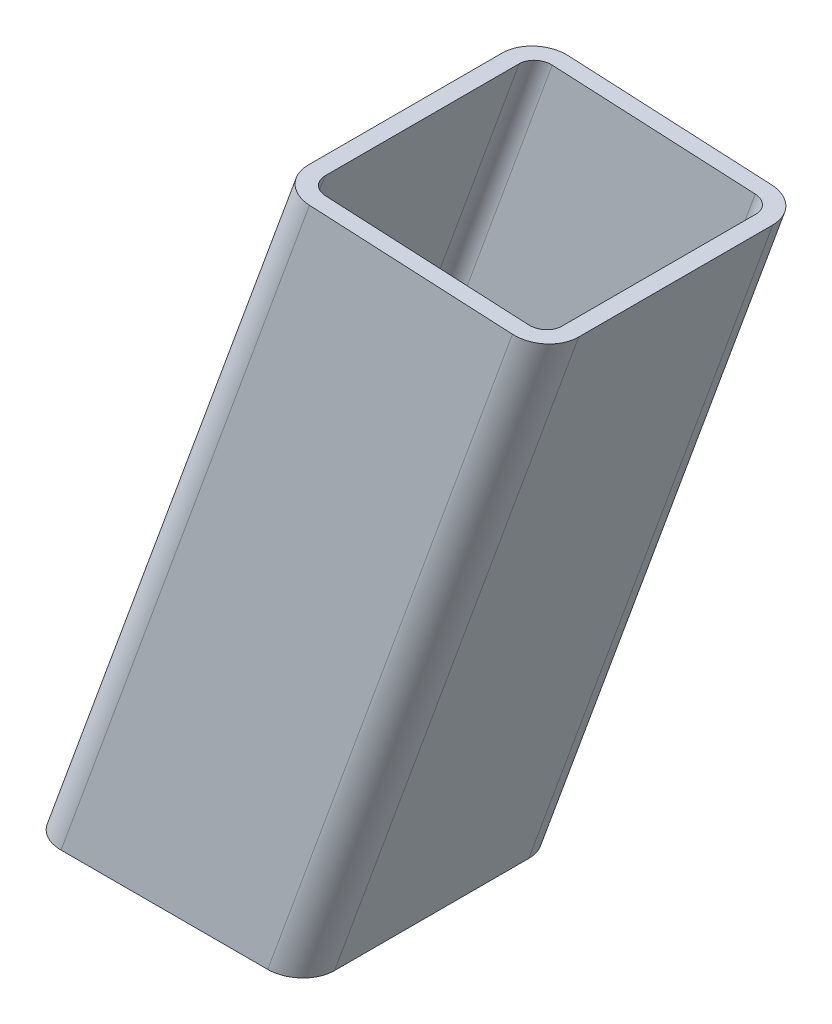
ISO-10303-21;
HEADER;
FILE_DESCRIPTION(('STEP AP214'),'2;1');
FILE_NAME('part.step','',(''),(''),'','','');
FILE_SCHEMA(('AUTOMOTIVE_DESIGN { 1 0 10303 214 1 1 1 1 }'));
ENDSEC;
DATA;
#1=APPLICATION_CONTEXT('core data for automotive mechanical design processes');
#2=APPLICATION_PROTOCOL_DEFINITION('international standard','automotive_design',2000,#1);
#3=PRODUCT_CONTEXT('',#1,'mechanical');
#4=PRODUCT('Part','Part','',(#3));
#5=PRODUCT_RELATED_PRODUCT_CATEGORY('part','',(#4));
#6=PRODUCT_DEFINITION_FORMATION('','',#4);
#7=PRODUCT_DEFINITION_CONTEXT('part definition',#1,'design');
#8=PRODUCT_DEFINITION('design','',#6,#7);
#9=PRODUCT_DEFINITION_SHAPE('','',#8);
#10=(LENGTH_UNIT() NAMED_UNIT(*) SI_UNIT(.MILLI.,.METRE.));
#11=(NAMED_UNIT(*) PLANE_ANGLE_UNIT() SI_UNIT($,.RADIAN.));
#12=(NAMED_UNIT(*) SI_UNIT($,.STERADIAN.) SOLID_ANGLE_UNIT());
#13=UNCERTAINTY_MEASURE_WITH_UNIT(LENGTH_MEASURE(1.E-05),#10,'distance_accuracy_value','');
#14=(GEOMETRIC_REPRESENTATION_CONTEXT(3) GLOBAL_UNCERTAINTY_ASSIGNED_CONTEXT((#13)) GLOBAL_UNIT_ASSIGNED_CONTEXT((#10,
#11,#12)) REPRESENTATION_CONTEXT('',''));
#15=CARTESIAN_POINT('',(0.,0.,0.));
#16=DIRECTION('',(0.,0.,1.));
#17=DIRECTION('',(1.,0.,0.));
#18=AXIS2_PLACEMENT_3D('',#15,#16,#17);
#19=CARTESIAN_POINT('',(1958.50631611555,329.189745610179,30.));
#20=DIRECTION('',(0.939692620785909,-0.342020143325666,0.));
#21=DIRECTION('',(0.342020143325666,0.93969262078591,0.));
#22=AXIS2_PLACEMENT_3D('',#19,#20,#21);
#23=PLANE('',#22);
#24=DIRECTION('',(0.,0.,-1.));
#25=VECTOR('',#24,1.);
#26=CARTESIAN_POINT('',(1859.43735064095,56.9999999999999,29.9999999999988));
#27=LINE('',#26,#25);
#28=CARTESIAN_POINT('',(1859.43735064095,57.,30.));
#29=VERTEX_POINT('',#28);
#30=CARTESIAN_POINT('',(1859.43735064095,57.0000000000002,-30.));
#31=VERTEX_POINT('',#30);
#32=EDGE_CURVE('E184',#29,#31,#27,.T.);
#33=ORIENTED_EDGE('',*,*,#32,.F.);
#34=DIRECTION('',(-0.342020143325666,-0.939692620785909,0.));
#35=VECTOR('',#34,1.);
#36=CARTESIAN_POINT('',(1958.50631611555,329.189745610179,30.));
#37=LINE('',#36,#35);
#38=CARTESIAN_POINT('',(1936.39354644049,268.435410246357,30.));
#39=VERTEX_POINT('',#38);
#40=EDGE_CURVE('E217',#39,#29,#37,.T.);
#41=ORIENTED_EDGE('',*,*,#40,.F.);
#42=DIRECTION('',(0.,0.,1.));
#43=VECTOR('',#42,1.);
#44=CARTESIAN_POINT('',(1936.39354644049,268.435410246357,30.));
#45=LINE('',#44,#43);
#46=CARTESIAN_POINT('',(1936.39354644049,268.435410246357,-30.));
#47=VERTEX_POINT('',#46);
#48=EDGE_CURVE('E227',#47,#39,#45,.T.);
#49=ORIENTED_EDGE('',*,*,#48,.F.);
#50=DIRECTION('',(-0.342020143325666,-0.939692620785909,0.));
#51=VECTOR('',#50,1.);
#52=CARTESIAN_POINT('',(1958.50631611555,329.189745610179,-30.));
#53=LINE('',#52,#51);
#54=EDGE_CURVE('E248',#47,#31,#53,.T.);
#55=ORIENTED_EDGE('',*,*,#54,.T.);
#56=EDGE_LOOP('',(#33,#41,#49,#55));
#57=FACE_BOUND('',#56,.T.);
#58=ADVANCED_FACE('F34',(#57),#23,.F.);
#59=CARTESIAN_POINT('',(1967.90324232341,325.769544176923,-30.));
#60=DIRECTION('',(-0.342020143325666,-0.939692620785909,0.));
#61=DIRECTION('',(0.939692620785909,-0.342020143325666,0.));
#62=AXIS2_PLACEMENT_3D('',#59,#60,#61);
#63=CYLINDRICAL_SURFACE('',#62,10.);
#64=CARTESIAN_POINT('',(1870.07912836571,57.0000000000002,-30.));
#65=DIRECTION('',(0.,-1.,0.));
#66=DIRECTION('',(-1.,0.,0.));
#67=AXIS2_PLACEMENT_3D('',#64,#65,#66);
#68=ELLIPSE('',#67,10.6417777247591,10.);
#69=CARTESIAN_POINT('',(1870.07912836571,57.0000000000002,-40.));
#70=VERTEX_POINT('',#69);
#71=EDGE_CURVE('E183',#31,#70,#68,.T.);
#72=ORIENTED_EDGE('',*,*,#71,.F.);
#73=ORIENTED_EDGE('',*,*,#54,.F.);
#74=CARTESIAN_POINT('',(1946.84486584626,267.912130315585,-30.));
#75=DIRECTION('',(0.0500056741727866,0.998748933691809,0.));
#76=DIRECTION('',(-0.998748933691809,0.0500056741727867,0.));
#77=AXIS2_PLACEMENT_3D('',#74,#75,#76);
#78=ELLIPSE('',#77,10.464411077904,10.);
#79=CARTESIAN_POINT('',(1946.84486584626,267.912130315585,-40.));
#80=VERTEX_POINT('',#79);
#81=EDGE_CURVE('E122',#80,#47,#78,.T.);
#82=ORIENTED_EDGE('',*,*,#81,.F.);
#83=DIRECTION('',(-0.342020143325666,-0.939692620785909,0.));
#84=VECTOR('',#83,1.);
#85=CARTESIAN_POINT('',(1967.90324232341,325.769544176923,-40.));
#86=LINE('',#85,#84);
#87=EDGE_CURVE('E245',#80,#70,#86,.T.);
#88=ORIENTED_EDGE('',*,*,#87,.T.);
#89=EDGE_LOOP('',(#72,#73,#82,#88));
#90=FACE_BOUND('',#89,.T.);
#91=ADVANCED_FACE('F308',(#90),#63,.T.);
#92=CARTESIAN_POINT('',(2024.28479957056,305.248335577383,-40.));
#93=DIRECTION('',(0.,0.,1.));
#94=DIRECTION('',(1.,0.,0.));
#95=AXIS2_PLACEMENT_3D('',#92,#93,#94);
#96=PLANE('',#95);
#97=DIRECTION('',(1.,0.,0.));
#98=VECTOR('',#97,1.);
#99=CARTESIAN_POINT('',(2024.28479957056,57.0000000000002,-40.));
#100=LINE('',#99,#98);
#101=CARTESIAN_POINT('',(1933.92979471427,57.0000000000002,-40.));
#102=VERTEX_POINT('',#101);
#103=EDGE_CURVE('E181',#70,#102,#100,.T.);
#104=ORIENTED_EDGE('',*,*,#103,.F.);
#105=ORIENTED_EDGE('',*,*,#87,.F.);
#106=DIRECTION('',(-0.998748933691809,0.0500056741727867,0.));
#107=VECTOR('',#106,1.);
#108=CARTESIAN_POINT('',(2022.2264694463,264.137900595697,-40.));
#109=LINE('',#108,#107);
#110=CARTESIAN_POINT('',(2009.55278228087,264.772450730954,-40.));
#111=VERTEX_POINT('',#110);
#112=EDGE_CURVE('E118',#111,#80,#109,.T.);
#113=ORIENTED_EDGE('',*,*,#112,.F.);
#114=DIRECTION('',(-0.342020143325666,-0.939692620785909,0.));
#115=VECTOR('',#114,1.);
#116=CARTESIAN_POINT('',(2024.28479957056,305.248335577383,-40.));
#117=LINE('',#116,#115);
#118=EDGE_CURVE('E242',#111,#102,#117,.T.);
#119=ORIENTED_EDGE('',*,*,#118,.T.);
#120=EDGE_LOOP('',(#104,#105,#113,#119));
#121=FACE_BOUND('',#120,.T.);
#122=ADVANCED_FACE('F306',(#121),#96,.F.);
#123=CARTESIAN_POINT('',(2024.28479957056,305.248335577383,-30.));
#124=DIRECTION('',(-0.342020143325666,-0.939692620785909,0.));
#125=DIRECTION('',(0.939692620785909,-0.342020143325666,0.));
#126=AXIS2_PLACEMENT_3D('',#123,#124,#125);
#127=CYLINDRICAL_SURFACE('',#126,10.);
#128=CARTESIAN_POINT('',(1933.92979471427,57.0000000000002,-30.));
#129=DIRECTION('',(0.,-1.,0.));
#130=DIRECTION('',(-1.,0.,0.));
#131=AXIS2_PLACEMENT_3D('',#128,#129,#130);
#132=ELLIPSE('',#131,10.6417777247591,10.);
#133=CARTESIAN_POINT('',(1944.57157243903,57.0000000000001,-30.));
#134=VERTEX_POINT('',#133);
#135=EDGE_CURVE('E179',#102,#134,#132,.T.);
#136=ORIENTED_EDGE('',*,*,#135,.F.);
#137=ORIENTED_EDGE('',*,*,#118,.F.);
#138=CARTESIAN_POINT('',(2009.55278228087,264.772450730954,-30.));
#139=DIRECTION('',(0.0500056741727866,0.998748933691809,0.));
#140=DIRECTION('',(-0.998748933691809,0.0500056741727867,0.));
#141=AXIS2_PLACEMENT_3D('',#138,#139,#140);
#142=ELLIPSE('',#141,10.4644110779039,10.);
#143=CARTESIAN_POINT('',(2020.00410168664,264.249170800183,-30.));
#144=VERTEX_POINT('',#143);
#145=EDGE_CURVE('E223',#144,#111,#142,.T.);
#146=ORIENTED_EDGE('',*,*,#145,.F.);
#147=DIRECTION('',(-0.342020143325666,-0.939692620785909,0.));
#148=VECTOR('',#147,1.);
#149=CARTESIAN_POINT('',(2033.68172577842,301.828134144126,-30.));
#150=LINE('',#149,#148);
#151=EDGE_CURVE('E239',#144,#134,#150,.T.);
#152=ORIENTED_EDGE('',*,*,#151,.T.);
#153=EDGE_LOOP('',(#136,#137,#146,#152));
#154=FACE_BOUND('',#153,.T.);
#155=ADVANCED_FACE('F301',(#154),#127,.T.);
#156=CARTESIAN_POINT('',(2033.68172577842,301.828134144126,-30.));
#157=DIRECTION('',(-0.939692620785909,0.342020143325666,0.));
#158=DIRECTION('',(-0.342020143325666,-0.93969262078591,0.));
#159=AXIS2_PLACEMENT_3D('',#156,#157,#158);
#160=PLANE('',#159);
#161=DIRECTION('',(0.,0.,1.));
#162=VECTOR('',#161,1.);
#163=CARTESIAN_POINT('',(1944.57157243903,57.0000000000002,-30.0000000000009));
#164=LINE('',#163,#162);
#165=CARTESIAN_POINT('',(1944.57157243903,57.,30.));
#166=VERTEX_POINT('',#165);
#167=EDGE_CURVE('E173',#134,#166,#164,.T.);
#168=ORIENTED_EDGE('',*,*,#167,.F.);
#169=ORIENTED_EDGE('',*,*,#151,.F.);
#170=DIRECTION('',(0.,0.,-1.));
#171=VECTOR('',#170,1.);
#172=CARTESIAN_POINT('',(2020.00410168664,264.249170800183,-30.));
#173=LINE('',#172,#171);
#174=CARTESIAN_POINT('',(2020.00410168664,264.249170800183,30.));
#175=VERTEX_POINT('',#174);
#176=EDGE_CURVE('E221',#175,#144,#173,.T.);
#177=ORIENTED_EDGE('',*,*,#176,.F.);
#178=DIRECTION('',(-0.342020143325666,-0.939692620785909,0.));
#179=VECTOR('',#178,1.);
#180=CARTESIAN_POINT('',(2033.68172577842,301.828134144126,30.));
#181=LINE('',#180,#179);
#182=EDGE_CURVE('E236',#175,#166,#181,.T.);
#183=ORIENTED_EDGE('',*,*,#182,.T.);
#184=EDGE_LOOP('',(#168,#169,#177,#183));
#185=FACE_BOUND('',#184,.T.);
#186=ADVANCED_FACE('F298',(#185),#160,.F.);
#187=CARTESIAN_POINT('',(2024.28479957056,305.248335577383,30.));
#188=DIRECTION('',(-0.342020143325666,-0.939692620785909,0.));
#189=DIRECTION('',(0.939692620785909,-0.342020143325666,0.));
#190=AXIS2_PLACEMENT_3D('',#187,#188,#189);
#191=CYLINDRICAL_SURFACE('',#190,10.);
#192=CARTESIAN_POINT('',(1933.92979471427,57.,30.));
#193=DIRECTION('',(0.,-1.,0.));
#194=DIRECTION('',(-1.,0.,0.));
#195=AXIS2_PLACEMENT_3D('',#192,#193,#194);
#196=ELLIPSE('',#195,10.6417777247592,10.);
#197=CARTESIAN_POINT('',(1933.92979471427,57.,40.));
#198=VERTEX_POINT('',#197);
#199=EDGE_CURVE('E171',#166,#198,#196,.T.);
#200=ORIENTED_EDGE('',*,*,#199,.F.);
#201=ORIENTED_EDGE('',*,*,#182,.F.);
#202=CARTESIAN_POINT('',(2009.55278228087,264.772450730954,30.));
#203=DIRECTION('',(0.0500056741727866,0.998748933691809,0.));
#204=DIRECTION('',(-0.998748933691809,0.0500056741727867,0.));
#205=AXIS2_PLACEMENT_3D('',#202,#203,#204);
#206=ELLIPSE('',#205,10.464411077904,10.);
#207=CARTESIAN_POINT('',(2009.55278228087,264.772450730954,40.));
#208=VERTEX_POINT('',#207);
#209=EDGE_CURVE('E219',#208,#175,#206,.T.);
#210=ORIENTED_EDGE('',*,*,#209,.F.);
#211=DIRECTION('',(-0.342020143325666,-0.939692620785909,0.));
#212=VECTOR('',#211,1.);
#213=CARTESIAN_POINT('',(2024.28479957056,305.248335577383,40.));
#214=LINE('',#213,#212);
#215=EDGE_CURVE('E233',#208,#198,#214,.T.);
#216=ORIENTED_EDGE('',*,*,#215,.T.);
#217=EDGE_LOOP('',(#200,#201,#210,#216));
#218=FACE_BOUND('',#217,.T.);
#219=ADVANCED_FACE('F291',(#218),#191,.T.);
#220=CARTESIAN_POINT('',(1967.90324232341,325.769544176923,40.));
#221=DIRECTION('',(0.,0.,-1.));
#222=DIRECTION('',(-1.,0.,0.));
#223=AXIS2_PLACEMENT_3D('',#220,#221,#222);
#224=PLANE('',#223);
#225=DIRECTION('',(-1.,0.,0.));
#226=VECTOR('',#225,1.);
#227=CARTESIAN_POINT('',(1967.90324232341,56.9999999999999,40.));
#228=LINE('',#227,#226);
#229=CARTESIAN_POINT('',(1870.07912836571,56.9999999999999,40.));
#230=VERTEX_POINT('',#229);
#231=EDGE_CURVE('E53',#198,#230,#228,.T.);
#232=ORIENTED_EDGE('',*,*,#231,.F.);
#233=ORIENTED_EDGE('',*,*,#215,.F.);
#234=DIRECTION('',(0.998748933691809,-0.0500056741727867,0.));
#235=VECTOR('',#234,1.);
#236=CARTESIAN_POINT('',(1964.96100503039,267.005085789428,40.));
#237=LINE('',#236,#235);
#238=CARTESIAN_POINT('',(1946.84486584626,267.912130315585,40.));
#239=VERTEX_POINT('',#238);
#240=EDGE_CURVE('E216',#239,#208,#237,.T.);
#241=ORIENTED_EDGE('',*,*,#240,.F.);
#242=DIRECTION('',(-0.342020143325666,-0.939692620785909,0.));
#243=VECTOR('',#242,1.);
#244=CARTESIAN_POINT('',(1967.90324232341,325.769544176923,40.));
#245=LINE('',#244,#243);
#246=EDGE_CURVE('E230',#239,#230,#245,.T.);
#247=ORIENTED_EDGE('',*,*,#246,.T.);
#248=EDGE_LOOP('',(#232,#233,#241,#247));
#249=FACE_BOUND('',#248,.T.);
#250=ADVANCED_FACE('F288',(#249),#224,.F.);
#251=CARTESIAN_POINT('',(1967.90324232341,325.769544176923,30.));
#252=DIRECTION('',(-0.342020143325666,-0.939692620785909,0.));
#253=DIRECTION('',(0.939692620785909,-0.342020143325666,0.));
#254=AXIS2_PLACEMENT_3D('',#251,#252,#253);
#255=CYLINDRICAL_SURFACE('',#254,10.);
#256=CARTESIAN_POINT('',(1870.07912836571,56.9999999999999,30.));
#257=DIRECTION('',(0.,-1.,0.));
#258=DIRECTION('',(-1.,0.,0.));
#259=AXIS2_PLACEMENT_3D('',#256,#257,#258);
#260=ELLIPSE('',#259,10.6417777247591,10.);
#261=EDGE_CURVE('E176',#230,#29,#260,.T.);
#262=ORIENTED_EDGE('',*,*,#261,.F.);
#263=ORIENTED_EDGE('',*,*,#246,.F.);
#264=CARTESIAN_POINT('',(1946.84486584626,267.912130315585,30.));
#265=DIRECTION('',(0.0500056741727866,0.998748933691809,0.));
#266=DIRECTION('',(-0.998748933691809,0.0500056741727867,0.));
#267=AXIS2_PLACEMENT_3D('',#264,#265,#266);
#268=ELLIPSE('',#267,10.464411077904,10.);
#269=EDGE_CURVE('E214',#39,#239,#268,.T.);
#270=ORIENTED_EDGE('',*,*,#269,.F.);
#271=ORIENTED_EDGE('',*,*,#40,.T.);
#272=EDGE_LOOP('',(#262,#263,#270,#271));
#273=FACE_BOUND('',#272,.T.);
#274=ADVANCED_FACE('F36',(#273),#255,.T.);
#275=CARTESIAN_POINT('',(6158.08276398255,57.0625533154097,-40.));
#276=DIRECTION('',(0.0500056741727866,0.998748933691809,0.));
#277=DIRECTION('',(-0.998748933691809,0.0500056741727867,0.));
#278=AXIS2_PLACEMENT_3D('',#275,#276,#277);
#279=PLANE('',#278);
#280=DIRECTION('',(0.998748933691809,-0.0500056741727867,0.));
#281=VECTOR('',#280,1.);
#282=CARTESIAN_POINT('',(1964.96100503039,267.005085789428,35.));
#283=LINE('',#282,#281);
#284=CARTESIAN_POINT('',(1946.84486584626,267.912130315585,35.));
#285=VERTEX_POINT('',#284);
#286=CARTESIAN_POINT('',(2009.55278228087,264.772450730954,35.));
#287=VERTEX_POINT('',#286);
#288=EDGE_CURVE('E186',#285,#287,#283,.T.);
#289=ORIENTED_EDGE('',*,*,#288,.F.);
#290=CARTESIAN_POINT('',(1946.84486584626,267.912130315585,30.));
#291=DIRECTION('',(0.0500056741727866,0.998748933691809,0.));
#292=DIRECTION('',(-0.998748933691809,0.0500056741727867,0.));
#293=AXIS2_PLACEMENT_3D('',#290,#291,#292);
#294=ELLIPSE('',#293,5.23220553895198,5.00000000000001);
#295=CARTESIAN_POINT('',(1941.61920614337,268.173770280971,30.));
#296=VERTEX_POINT('',#295);
#297=EDGE_CURVE('E191',#296,#285,#294,.T.);
#298=ORIENTED_EDGE('',*,*,#297,.F.);
#299=DIRECTION('',(0.,0.,1.));
#300=VECTOR('',#299,1.);
#301=CARTESIAN_POINT('',(1941.61920614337,268.173770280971,30.));
#302=LINE('',#301,#300);
#303=CARTESIAN_POINT('',(1941.61920614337,268.173770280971,-30.));
#304=VERTEX_POINT('',#303);
#305=EDGE_CURVE('E196',#304,#296,#302,.T.);
#306=ORIENTED_EDGE('',*,*,#305,.F.);
#307=CARTESIAN_POINT('',(1946.84486584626,267.912130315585,-30.));
#308=DIRECTION('',(0.0500056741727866,0.998748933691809,0.));
#309=DIRECTION('',(-0.998748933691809,0.0500056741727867,0.));
#310=AXIS2_PLACEMENT_3D('',#307,#308,#309);
#311=ELLIPSE('',#310,5.23220553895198,5.00000000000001);
#312=CARTESIAN_POINT('',(1946.84486584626,267.912130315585,-35.));
#313=VERTEX_POINT('',#312);
#314=EDGE_CURVE('E201',#313,#304,#311,.T.);
#315=ORIENTED_EDGE('',*,*,#314,.F.);
#316=DIRECTION('',(-0.998748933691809,0.0500056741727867,0.));
#317=VECTOR('',#316,1.);
#318=CARTESIAN_POINT('',(2022.2264694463,264.137900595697,-35.));
#319=LINE('',#318,#317);
#320=CARTESIAN_POINT('',(2009.55278228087,264.772450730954,-35.));
#321=VERTEX_POINT('',#320);
#322=EDGE_CURVE('E206',#321,#313,#319,.T.);
#323=ORIENTED_EDGE('',*,*,#322,.F.);
#324=CARTESIAN_POINT('',(2009.55278228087,264.772450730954,-30.));
#325=DIRECTION('',(0.0500056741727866,0.998748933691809,0.));
#326=DIRECTION('',(-0.998748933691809,0.0500056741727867,0.));
#327=AXIS2_PLACEMENT_3D('',#324,#325,#326);
#328=ELLIPSE('',#327,5.23220553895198,5.00000000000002);
#329=CARTESIAN_POINT('',(2014.77844198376,264.510810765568,-30.));
#330=VERTEX_POINT('',#329);
#331=EDGE_CURVE('E167',#330,#321,#328,.T.);
#332=ORIENTED_EDGE('',*,*,#331,.F.);
#333=DIRECTION('',(0.,0.,-1.));
#334=VECTOR('',#333,1.);
#335=CARTESIAN_POINT('',(2014.77844198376,264.510810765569,-30.));
#336=LINE('',#335,#334);
#337=CARTESIAN_POINT('',(2014.77844198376,264.510810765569,30.));
#338=VERTEX_POINT('',#337);
#339=EDGE_CURVE('E158',#338,#330,#336,.T.);
#340=ORIENTED_EDGE('',*,*,#339,.F.);
#341=CARTESIAN_POINT('',(2009.55278228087,264.772450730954,30.));
#342=DIRECTION('',(0.0500056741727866,0.998748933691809,0.));
#343=DIRECTION('',(-0.998748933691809,0.0500056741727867,0.));
#344=AXIS2_PLACEMENT_3D('',#341,#342,#343);
#345=ELLIPSE('',#344,5.23220553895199,5.00000000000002);
#346=EDGE_CURVE('E11',#287,#338,#345,.T.);
#347=ORIENTED_EDGE('',*,*,#346,.F.);
#348=EDGE_LOOP('',(#289,#298,#306,#315,#323,#332,#340,#347));
#349=FACE_BOUND('',#348,.T.);
#350=ORIENTED_EDGE('',*,*,#269,.T.);
#351=ORIENTED_EDGE('',*,*,#240,.T.);
#352=ORIENTED_EDGE('',*,*,#209,.T.);
#353=ORIENTED_EDGE('',*,*,#176,.T.);
#354=ORIENTED_EDGE('',*,*,#145,.T.);
#355=ORIENTED_EDGE('',*,*,#112,.T.);
#356=ORIENTED_EDGE('',*,*,#81,.T.);
#357=ORIENTED_EDGE('',*,*,#48,.T.);
#358=EDGE_LOOP('',(#350,#351,#352,#353,#354,#355,#356,#357));
#359=FACE_BOUND('',#358,.T.);
#360=ADVANCED_FACE('F284',(#349,#359),#279,.T.);
#361=CARTESIAN_POINT('',(9149.96897120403,57.0000000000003,-59.9999999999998));
#362=DIRECTION('',(0.,-1.,0.));
#363=DIRECTION('',(0.,0.,-1.));
#364=AXIS2_PLACEMENT_3D('',#361,#362,#363);
#365=PLANE('',#364);
#366=DIRECTION('',(0.,0.,1.));
#367=VECTOR('',#366,1.);
#368=CARTESIAN_POINT('',(1939.25068357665,57.0000000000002,-30.000000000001));
#369=LINE('',#368,#367);
#370=CARTESIAN_POINT('',(1939.25068357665,57.0000000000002,-30.));
#371=VERTEX_POINT('',#370);
#372=CARTESIAN_POINT('',(1939.25068357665,57.0000000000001,30.));
#373=VERTEX_POINT('',#372);
#374=EDGE_CURVE('E151',#371,#373,#369,.T.);
#375=ORIENTED_EDGE('',*,*,#374,.F.);
#376=CARTESIAN_POINT('',(1933.92979471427,57.0000000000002,-30.));
#377=DIRECTION('',(0.,-1.,0.));
#378=DIRECTION('',(-1.,0.,0.));
#379=AXIS2_PLACEMENT_3D('',#376,#377,#378);
#380=ELLIPSE('',#379,5.32088886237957,5.00000000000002);
#381=CARTESIAN_POINT('',(1933.92979471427,57.0000000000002,-35.));
#382=VERTEX_POINT('',#381);
#383=EDGE_CURVE('E147',#382,#371,#380,.T.);
#384=ORIENTED_EDGE('',*,*,#383,.F.);
#385=DIRECTION('',(1.,0.,0.));
#386=VECTOR('',#385,1.);
#387=CARTESIAN_POINT('',(2024.28479957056,57.0000000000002,-35.));
#388=LINE('',#387,#386);
#389=CARTESIAN_POINT('',(1870.07912836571,57.0000000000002,-35.));
#390=VERTEX_POINT('',#389);
#391=EDGE_CURVE('E210',#390,#382,#388,.T.);
#392=ORIENTED_EDGE('',*,*,#391,.F.);
#393=CARTESIAN_POINT('',(1870.07912836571,57.0000000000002,-30.));
#394=DIRECTION('',(0.,-1.,0.));
#395=DIRECTION('',(-1.,0.,0.));
#396=AXIS2_PLACEMENT_3D('',#393,#394,#395);
#397=ELLIPSE('',#396,5.32088886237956,5.00000000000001);
#398=CARTESIAN_POINT('',(1864.75823950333,57.0000000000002,-30.));
#399=VERTEX_POINT('',#398);
#400=EDGE_CURVE('E205',#399,#390,#397,.T.);
#401=ORIENTED_EDGE('',*,*,#400,.F.);
#402=DIRECTION('',(0.,0.,-1.));
#403=VECTOR('',#402,1.);
#404=CARTESIAN_POINT('',(1864.75823950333,56.9999999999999,29.9999999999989));
#405=LINE('',#404,#403);
#406=CARTESIAN_POINT('',(1864.75823950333,56.9999999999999,30.));
#407=VERTEX_POINT('',#406);
#408=EDGE_CURVE('E200',#407,#399,#405,.T.);
#409=ORIENTED_EDGE('',*,*,#408,.F.);
#410=CARTESIAN_POINT('',(1870.07912836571,56.9999999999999,30.));
#411=DIRECTION('',(0.,-1.,0.));
#412=DIRECTION('',(-1.,0.,0.));
#413=AXIS2_PLACEMENT_3D('',#410,#411,#412);
#414=ELLIPSE('',#413,5.32088886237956,5.00000000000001);
#415=CARTESIAN_POINT('',(1870.07912836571,56.9999999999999,35.));
#416=VERTEX_POINT('',#415);
#417=EDGE_CURVE('E195',#416,#407,#414,.T.);
#418=ORIENTED_EDGE('',*,*,#417,.F.);
#419=DIRECTION('',(-1.,0.,0.));
#420=VECTOR('',#419,1.);
#421=CARTESIAN_POINT('',(1967.90324232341,56.9999999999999,35.));
#422=LINE('',#421,#420);
#423=CARTESIAN_POINT('',(1933.92979471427,56.9999999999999,35.));
#424=VERTEX_POINT('',#423);
#425=EDGE_CURVE('E190',#424,#416,#422,.T.);
#426=ORIENTED_EDGE('',*,*,#425,.F.);
#427=CARTESIAN_POINT('',(1933.92979471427,57.,30.));
#428=DIRECTION('',(0.,-1.,0.));
#429=DIRECTION('',(-1.,0.,0.));
#430=AXIS2_PLACEMENT_3D('',#427,#428,#429);
#431=ELLIPSE('',#430,5.32088886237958,5.00000000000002);
#432=EDGE_CURVE('E44',#373,#424,#431,.T.);
#433=ORIENTED_EDGE('',*,*,#432,.F.);
#434=EDGE_LOOP('',(#375,#384,#392,#401,#409,#418,#426,#433));
#435=FACE_BOUND('',#434,.T.);
#436=ORIENTED_EDGE('',*,*,#261,.T.);
#437=ORIENTED_EDGE('',*,*,#32,.T.);
#438=ORIENTED_EDGE('',*,*,#71,.T.);
#439=ORIENTED_EDGE('',*,*,#103,.T.);
#440=ORIENTED_EDGE('',*,*,#135,.T.);
#441=ORIENTED_EDGE('',*,*,#167,.T.);
#442=ORIENTED_EDGE('',*,*,#199,.T.);
#443=ORIENTED_EDGE('',*,*,#231,.T.);
#444=EDGE_LOOP('',(#436,#437,#438,#439,#440,#441,#442,#443));
#445=FACE_BOUND('',#444,.T.);
#446=ADVANCED_FACE('F152',(#435,#445),#365,.T.);
#447=CARTESIAN_POINT('',(2028.98326267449,303.538234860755,-30.));
#448=DIRECTION('',(-0.939692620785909,0.342020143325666,0.));
#449=DIRECTION('',(-0.342020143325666,-0.939692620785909,0.));
#450=AXIS2_PLACEMENT_3D('',#447,#448,#449);
#451=PLANE('',#450);
#452=DIRECTION('',(-0.342020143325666,-0.939692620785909,0.));
#453=VECTOR('',#452,1.);
#454=CARTESIAN_POINT('',(2028.98326267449,303.538234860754,-30.));
#455=LINE('',#454,#453);
#456=EDGE_CURVE('E38',#330,#371,#455,.T.);
#457=ORIENTED_EDGE('',*,*,#456,.T.);
#458=ORIENTED_EDGE('',*,*,#374,.T.);
#459=DIRECTION('',(-0.342020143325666,-0.939692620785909,0.));
#460=VECTOR('',#459,1.);
#461=CARTESIAN_POINT('',(2028.98326267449,303.538234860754,30.));
#462=LINE('',#461,#460);
#463=EDGE_CURVE('E189',#338,#373,#462,.T.);
#464=ORIENTED_EDGE('',*,*,#463,.F.);
#465=ORIENTED_EDGE('',*,*,#339,.T.);
#466=EDGE_LOOP('',(#457,#458,#464,#465));
#467=FACE_BOUND('',#466,.T.);
#468=ADVANCED_FACE('F170',(#467),#451,.T.);
#469=CARTESIAN_POINT('',(2024.28479957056,305.248335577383,-30.));
#470=DIRECTION('',(-0.342020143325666,-0.939692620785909,0.));
#471=DIRECTION('',(0.939692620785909,-0.342020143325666,0.));
#472=AXIS2_PLACEMENT_3D('',#469,#470,#471);
#473=CYLINDRICAL_SURFACE('',#472,5.00000000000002);
#474=DIRECTION('',(-0.342020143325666,-0.939692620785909,0.));
#475=VECTOR('',#474,1.);
#476=CARTESIAN_POINT('',(2024.28479957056,305.248335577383,-35.));
#477=LINE('',#476,#475);
#478=EDGE_CURVE('E166',#321,#382,#477,.T.);
#479=ORIENTED_EDGE('',*,*,#478,.T.);
#480=ORIENTED_EDGE('',*,*,#383,.T.);
#481=ORIENTED_EDGE('',*,*,#456,.F.);
#482=ORIENTED_EDGE('',*,*,#331,.T.);
#483=EDGE_LOOP('',(#479,#480,#481,#482));
#484=FACE_BOUND('',#483,.T.);
#485=ADVANCED_FACE('F163',(#484),#473,.F.);
#486=CARTESIAN_POINT('',(2024.28479957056,305.248335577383,-35.));
#487=DIRECTION('',(0.,0.,1.));
#488=DIRECTION('',(1.,0.,0.));
#489=AXIS2_PLACEMENT_3D('',#486,#487,#488);
#490=PLANE('',#489);
#491=DIRECTION('',(-0.342020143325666,-0.939692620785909,0.));
#492=VECTOR('',#491,1.);
#493=CARTESIAN_POINT('',(1967.90324232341,325.769544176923,-35.));
#494=LINE('',#493,#492);
#495=EDGE_CURVE('E212',#313,#390,#494,.T.);
#496=ORIENTED_EDGE('',*,*,#495,.T.);
#497=ORIENTED_EDGE('',*,*,#391,.T.);
#498=ORIENTED_EDGE('',*,*,#478,.F.);
#499=ORIENTED_EDGE('',*,*,#322,.T.);
#500=EDGE_LOOP('',(#496,#497,#498,#499));
#501=FACE_BOUND('',#500,.T.);
#502=ADVANCED_FACE('F342',(#501),#490,.T.);
#503=CARTESIAN_POINT('',(1967.90324232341,325.769544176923,-30.));
#504=DIRECTION('',(-0.342020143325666,-0.939692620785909,0.));
#505=DIRECTION('',(0.939692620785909,-0.342020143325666,0.));
#506=AXIS2_PLACEMENT_3D('',#503,#504,#505);
#507=CYLINDRICAL_SURFACE('',#506,5.00000000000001);
#508=DIRECTION('',(-0.342020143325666,-0.939692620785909,0.));
#509=VECTOR('',#508,1.);
#510=CARTESIAN_POINT('',(1963.20477921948,327.479644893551,-30.));
#511=LINE('',#510,#509);
#512=EDGE_CURVE('E209',#304,#399,#511,.T.);
#513=ORIENTED_EDGE('',*,*,#512,.T.);
#514=ORIENTED_EDGE('',*,*,#400,.T.);
#515=ORIENTED_EDGE('',*,*,#495,.F.);
#516=ORIENTED_EDGE('',*,*,#314,.T.);
#517=EDGE_LOOP('',(#513,#514,#515,#516));
#518=FACE_BOUND('',#517,.T.);
#519=ADVANCED_FACE('F345',(#518),#507,.F.);
#520=CARTESIAN_POINT('',(1963.20477921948,327.479644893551,30.));
#521=DIRECTION('',(0.939692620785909,-0.342020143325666,0.));
#522=DIRECTION('',(0.342020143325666,0.939692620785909,0.));
#523=AXIS2_PLACEMENT_3D('',#520,#521,#522);
#524=PLANE('',#523);
#525=DIRECTION('',(-0.342020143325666,-0.939692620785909,0.));
#526=VECTOR('',#525,1.);
#527=CARTESIAN_POINT('',(1963.20477921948,327.479644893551,30.));
#528=LINE('',#527,#526);
#529=EDGE_CURVE('E204',#296,#407,#528,.T.);
#530=ORIENTED_EDGE('',*,*,#529,.T.);
#531=ORIENTED_EDGE('',*,*,#408,.T.);
#532=ORIENTED_EDGE('',*,*,#512,.F.);
#533=ORIENTED_EDGE('',*,*,#305,.T.);
#534=EDGE_LOOP('',(#530,#531,#532,#533));
#535=FACE_BOUND('',#534,.T.);
#536=ADVANCED_FACE('F348',(#535),#524,.T.);
#537=CARTESIAN_POINT('',(1967.90324232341,325.769544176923,30.));
#538=DIRECTION('',(-0.342020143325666,-0.939692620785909,0.));
#539=DIRECTION('',(0.939692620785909,-0.342020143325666,0.));
#540=AXIS2_PLACEMENT_3D('',#537,#538,#539);
#541=CYLINDRICAL_SURFACE('',#540,5.00000000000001);
#542=DIRECTION('',(-0.342020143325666,-0.939692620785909,0.));
#543=VECTOR('',#542,1.);
#544=CARTESIAN_POINT('',(1967.90324232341,325.769544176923,35.));
#545=LINE('',#544,#543);
#546=EDGE_CURVE('E199',#285,#416,#545,.T.);
#547=ORIENTED_EDGE('',*,*,#546,.T.);
#548=ORIENTED_EDGE('',*,*,#417,.T.);
#549=ORIENTED_EDGE('',*,*,#529,.F.);
#550=ORIENTED_EDGE('',*,*,#297,.T.);
#551=EDGE_LOOP('',(#547,#548,#549,#550));
#552=FACE_BOUND('',#551,.T.);
#553=ADVANCED_FACE('F352',(#552),#541,.F.);
#554=CARTESIAN_POINT('',(1967.90324232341,325.769544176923,35.));
#555=DIRECTION('',(0.,0.,-1.));
#556=DIRECTION('',(-1.,0.,0.));
#557=AXIS2_PLACEMENT_3D('',#554,#555,#556);
#558=PLANE('',#557);
#559=DIRECTION('',(-0.342020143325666,-0.939692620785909,0.));
#560=VECTOR('',#559,1.);
#561=CARTESIAN_POINT('',(2024.28479957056,305.248335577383,35.));
#562=LINE('',#561,#560);
#563=EDGE_CURVE('E194',#287,#424,#562,.T.);
#564=ORIENTED_EDGE('',*,*,#563,.T.);
#565=ORIENTED_EDGE('',*,*,#425,.T.);
#566=ORIENTED_EDGE('',*,*,#546,.F.);
#567=ORIENTED_EDGE('',*,*,#288,.T.);
#568=EDGE_LOOP('',(#564,#565,#566,#567));
#569=FACE_BOUND('',#568,.T.);
#570=ADVANCED_FACE('F356',(#569),#558,.T.);
#571=CARTESIAN_POINT('',(2024.28479957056,305.248335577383,30.));
#572=DIRECTION('',(-0.342020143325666,-0.939692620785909,0.));
#573=DIRECTION('',(0.939692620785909,-0.342020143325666,0.));
#574=AXIS2_PLACEMENT_3D('',#571,#572,#573);
#575=CYLINDRICAL_SURFACE('',#574,5.00000000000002);
#576=ORIENTED_EDGE('',*,*,#463,.T.);
#577=ORIENTED_EDGE('',*,*,#432,.T.);
#578=ORIENTED_EDGE('',*,*,#563,.F.);
#579=ORIENTED_EDGE('',*,*,#346,.T.);
#580=EDGE_LOOP('',(#576,#577,#578,#579));
#581=FACE_BOUND('',#580,.T.);
#582=ADVANCED_FACE('F359',(#581),#575,.F.);
#583=CLOSED_SHELL('',(#58,#91,#122,#155,#186,#219,#250,#274,#360,#446,#468,#485,#502,#519,#536,
#553,#570,#582));
#584=MANIFOLD_SOLID_BREP('B2',#583);
#585=ADVANCED_BREP_SHAPE_REPRESENTATION('',(#18,#584),#14);
#586=SHAPE_DEFINITION_REPRESENTATION(#9,#585);
ENDSEC;
END-ISO-10303-21;
